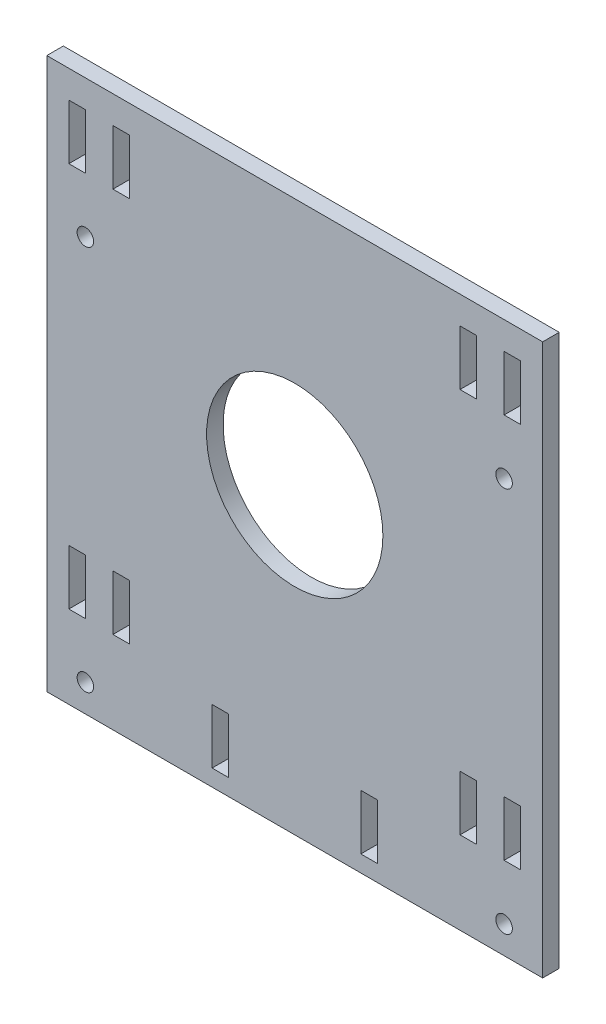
from build123d import *

# Parameters (mm, degrees)
SKETCH_3_R          = 16
EXTRUDE_2_DEPTH     = 3
SKETCH_5_W          = 3
SKETCH_5_H          = 10
CUT_EXTRUDE_2_DEPTH = 72.126647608
SKETCH_6_R          = 1.5
SKETCH_6_W          = 3
SKETCH_6_H          = 10
CUT_EXTRUDE_3_DEPTH = 10


with BuildPart() as part:
    # Sketch 3 → Extrude 2 (new body)
    with BuildSketch(Plane.XY):
        Polygon((45, 45), (-45, 45), (-45, -45), (-45, -55), (45, -55), (45, -45), align=None)
        Circle(SKETCH_3_R, mode=Mode.SUBTRACT)
    extrude(amount=EXTRUDE_2_DEPTH)

    # Sketch 5 → Cut-Extrude 2 (cut, through all)
    with BuildSketch(Plane.XY.offset(3)):
        with Locations((-31.5, 35)):
            Rectangle(SKETCH_5_W, SKETCH_5_H)
        with Locations((31.5, 35)):
            Rectangle(SKETCH_5_W, SKETCH_5_H)
        with Locations((-31.5, -35)):
            Rectangle(SKETCH_5_W, SKETCH_5_H)
        with Locations((31.5, -35)):
            Rectangle(SKETCH_5_W, SKETCH_5_H)
    extrude(amount=-CUT_EXTRUDE_2_DEPTH, mode=Mode.SUBTRACT)

    # Sketch 6 → Cut-Extrude 3 (cut)
    with BuildSketch(Plane.XY.offset(3)):
        with Locations((-38, -50)):
            Circle(SKETCH_6_R)
        with Locations((-38, 20)):
            Circle(SKETCH_6_R)
        with Locations((38, 20)):
            Circle(SKETCH_6_R)
        with Locations((38, -50)):
            Circle(SKETCH_6_R)
        with Locations((-39.5, -35)):
            Rectangle(SKETCH_6_W, SKETCH_6_H)
        with Locations((-39.5, 35)):
            Rectangle(SKETCH_6_W, SKETCH_6_H)
        with Locations((-13.5, -47)):
            Rectangle(SKETCH_6_W, SKETCH_6_H)
        with Locations((13.5, -47)):
            Rectangle(SKETCH_6_W, SKETCH_6_H)
        with Locations((39.5, 35)):
            Rectangle(SKETCH_6_W, SKETCH_6_H)
        with Locations((39.5, -35)):
            Rectangle(SKETCH_6_W, SKETCH_6_H)
    extrude(amount=-CUT_EXTRUDE_3_DEPTH, mode=Mode.SUBTRACT)


solid = part.part
